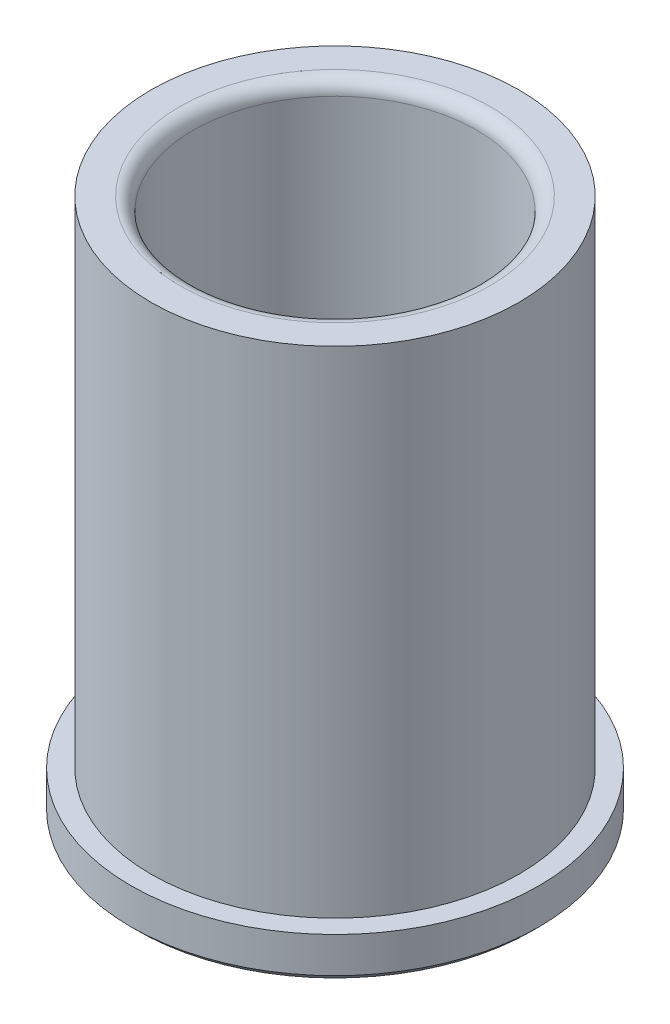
from build123d import *

# Parameters (mm, degrees)
FILLET1_R = 1.524


with BuildPart() as part:
    # Sketch1 → Revolve1 (revolve)
    with BuildSketch(Plane.XY, mode=Mode.PRIVATE) as revolve1_sk:
        Polygon((-22.1234, 0), (-22.8854, 0.762), (-22.8854, 4.7625), (-20.64385, 4.7625), (-20.64385, 60.325), (-15.88135, 60.325), (-15.88135, 0.762), (-16.64335, 0), align=None)
    revolve(revolve1_sk.sketch.rotate(Axis((0, -1000, 0), (0, 1, 0)), 180), axis=Axis((0, -1000, 0), (0, 1, 0)))

    # Fillet1
    fillet1_edges = [part.edges().sort_by_distance(p)[0] for p in [
        (-15.88135, 60.325, 0),
    ]]
    fillet(fillet1_edges, radius=FILLET1_R)


solid = part.part
